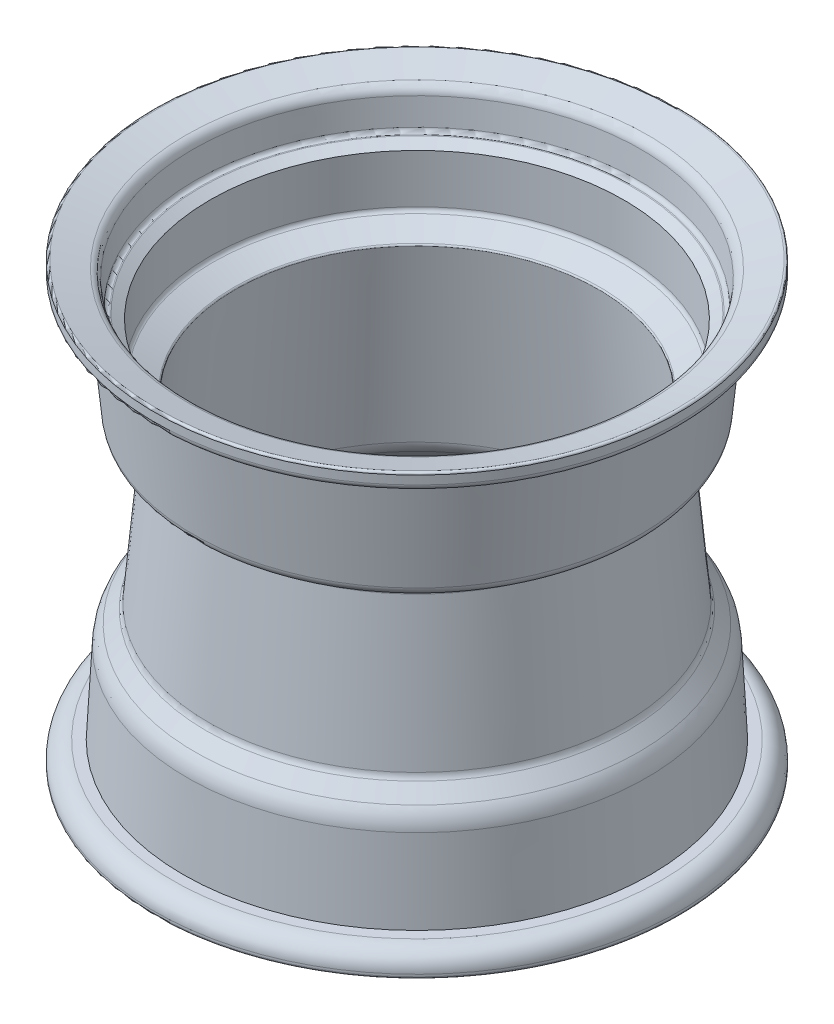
from build123d import *


with BuildPart() as part:
    # Sketch1 → Revolve1 (revolve)
    with BuildSketch(Plane.XY):
        with BuildLine():
            Line((-171.31, 68.825329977), (-186.61453753, -101.879127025))
            ThreePointArc((-186.61453753, -101.879127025), (-188.112768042, -107.730747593), (-191.388223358, -112.805937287))
            Line((-191.388223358, -112.805937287), (-202.141443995, -124.716881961))
            ThreePointArc((-202.141443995, -124.716881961), (-205.552462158, -130.110314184), (-206.96422598, -136.333744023))
            Line((-206.96422598, -136.333744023), (-211.110304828, -215.021584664))
            ThreePointArc((-211.110304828, -215.021584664), (-213.445826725, -220.084909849), (-218.625026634, -222.150778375))
            Line((-218.625026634, -222.150778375), (-230.139861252, -222.150778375))
            ThreePointArc((-230.139861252, -222.150778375), (-235.460943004, -224.354842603), (-237.665007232, -229.675924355))
            Line((-237.665007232, -229.675924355), (-237.665007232, -231.743087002))
            ThreePointArc((-237.665007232, -231.743087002), (-238.21602329, -233.07335744), (-239.546293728, -233.624373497))
            Line((-239.546293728, -233.624373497), (-245.190153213, -233.624373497))
            ThreePointArc((-245.190153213, -233.624373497), (-246.520423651, -233.07335744), (-247.071439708, -231.743087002))
            Line((-247.071439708, -231.743087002), (-247.071439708, -229.675924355))
            ThreePointArc((-247.071439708, -229.675924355), (-242.112295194, -217.703490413), (-230.139861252, -212.744345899))
            Line((-230.139861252, -212.744345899), (-220.409797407, -212.744345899))
            Line((-220.409797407, -212.744345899), (-216.357628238, -135.838803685))
            ThreePointArc((-216.357628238, -135.838803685), (-214.239982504, -126.503658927), (-209.123455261, -118.413510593))
            Line((-209.123455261, -118.413510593), (-198.370234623, -106.502565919))
            ThreePointArc((-198.370234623, -106.502565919), (-196.732506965, -103.964971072), (-195.983391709, -101.039160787))
            Line((-195.983391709, -101.039160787), (-183.713750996, 35.814524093))
            ThreePointArc((-183.713750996, 35.814524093), (-185.003890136, 41.4727198), (-189.36913333, 45.296891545))
            Line((-189.36913333, 45.296891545), (-204.729205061, 51.89681586))
            ThreePointArc((-204.729205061, 51.89681586), (-208.615640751, 54.996440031), (-210.379480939, 59.64411904))
            Line((-210.379480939, 59.64411904), (-219.197327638, 151.88886622))
            ThreePointArc((-219.197327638, 151.88886622), (-221.435065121, 157.133878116), (-226.291680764, 160.122339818))
            Line((-226.291680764, 160.122339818), (-242.789216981, 164.223684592))
            ThreePointArc((-242.789216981, 164.223684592), (-245.873816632, 166.224603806), (-247.071439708, 169.700827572))
            Line((-247.071439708, 169.700827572), (-247.071439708, 177.763108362))
            ThreePointArc((-247.071439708, 177.763108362), (-246.322630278, 179.265351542), (-244.672299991, 179.571717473))
            Line((-244.672299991, 179.571717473), (-217.650268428, 171.834586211))
            ThreePointArc((-217.650268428, 171.834586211), (-213.006561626, 168.805281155), (-210.875786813, 163.68663869))
            Line((-210.875786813, 163.68663869), (-208.570216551, 139.567740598))
            ThreePointArc((-208.570216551, 139.567740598), (-207.337022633, 137.124837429), (-204.774905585, 136.16353656))
            ThreePointArc((-204.774905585, 136.16353656), (-204.320917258, 136.104159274), (-203.902229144, 135.918872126))
            Line((-203.902229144, 135.918872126), (-194.930224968, 130.294803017))
            Line((-194.930224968, 130.294803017), (-194.930224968, 84.33606051))
            ThreePointArc((-194.930224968, 84.33606051), (-194.275466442, 82.042280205), (-192.508515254, 80.439775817))
            Line((-192.508515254, 80.439775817), (-172.285181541, 70.45597095))
            ThreePointArc((-172.285181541, 70.45597095), (-171.576611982, 69.772803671), (-171.31, 68.825329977))
        make_face()
    revolve(axis=Axis((2e-09, 224.365622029, 0), (0, -1, 0)))


solid = part.part
